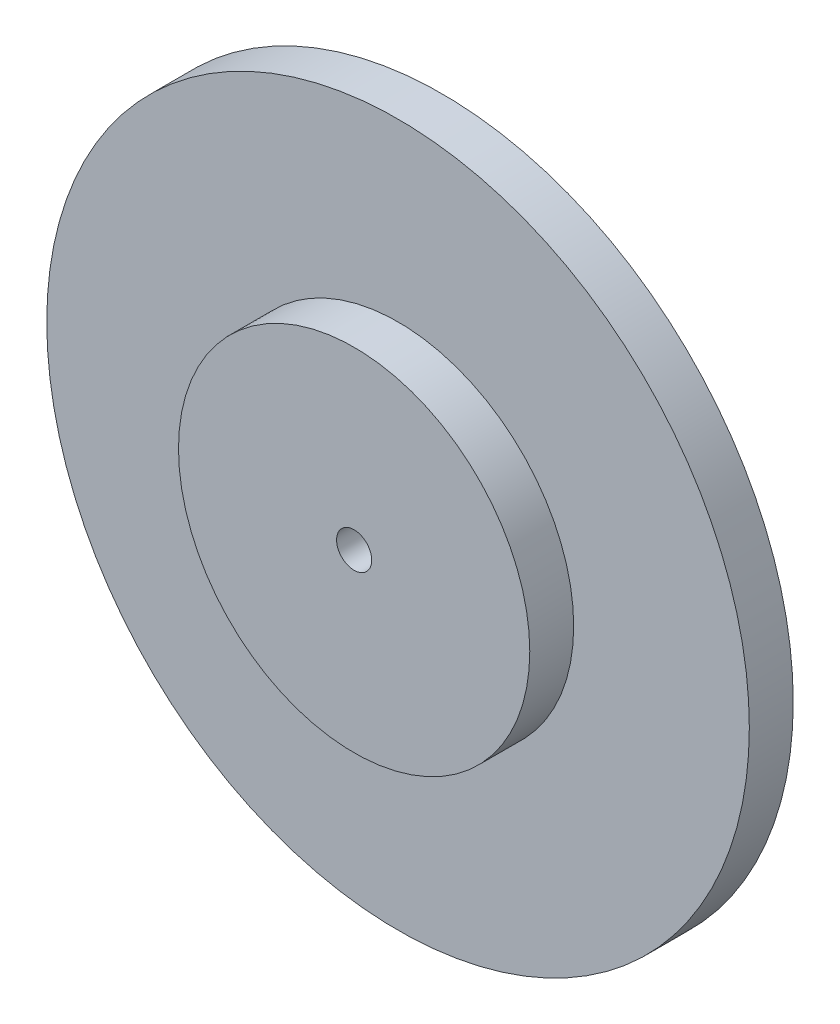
ISO-10303-21;
HEADER;
FILE_DESCRIPTION(('STEP AP214'),'2;1');
FILE_NAME('part.step','',(''),(''),'','','');
FILE_SCHEMA(('AUTOMOTIVE_DESIGN { 1 0 10303 214 1 1 1 1 }'));
ENDSEC;
DATA;
#1=APPLICATION_CONTEXT('core data for automotive mechanical design processes');
#2=APPLICATION_PROTOCOL_DEFINITION('international standard','automotive_design',2000,#1);
#3=PRODUCT_CONTEXT('',#1,'mechanical');
#4=PRODUCT('Part','Part','',(#3));
#5=PRODUCT_RELATED_PRODUCT_CATEGORY('part','',(#4));
#6=PRODUCT_DEFINITION_FORMATION('','',#4);
#7=PRODUCT_DEFINITION_CONTEXT('part definition',#1,'design');
#8=PRODUCT_DEFINITION('design','',#6,#7);
#9=PRODUCT_DEFINITION_SHAPE('','',#8);
#10=(LENGTH_UNIT() NAMED_UNIT(*) SI_UNIT(.MILLI.,.METRE.));
#11=(NAMED_UNIT(*) PLANE_ANGLE_UNIT() SI_UNIT($,.RADIAN.));
#12=(NAMED_UNIT(*) SI_UNIT($,.STERADIAN.) SOLID_ANGLE_UNIT());
#13=UNCERTAINTY_MEASURE_WITH_UNIT(LENGTH_MEASURE(1.E-05),#10,'distance_accuracy_value','');
#14=(GEOMETRIC_REPRESENTATION_CONTEXT(3) GLOBAL_UNCERTAINTY_ASSIGNED_CONTEXT((#13)) GLOBAL_UNIT_ASSIGNED_CONTEXT((#10,
#11,#12)) REPRESENTATION_CONTEXT('',''));
#15=CARTESIAN_POINT('',(0.,0.,0.));
#16=DIRECTION('',(0.,0.,1.));
#17=DIRECTION('',(1.,0.,0.));
#18=AXIS2_PLACEMENT_3D('',#15,#16,#17);
#19=CARTESIAN_POINT('',(0.,0.,6.35));
#20=DIRECTION('',(0.,0.,-1.));
#21=DIRECTION('',(-1.,0.,0.));
#22=AXIS2_PLACEMENT_3D('',#19,#20,#21);
#23=CYLINDRICAL_SURFACE('',#22,50.8);
#24=CARTESIAN_POINT('',(0.,0.,6.35));
#25=DIRECTION('',(0.,0.,1.));
#26=DIRECTION('',(1.,0.,0.));
#27=AXIS2_PLACEMENT_3D('',#24,#25,#26);
#28=CIRCLE('',#27,50.8);
#29=CARTESIAN_POINT('',(50.8,0.,6.35));
#30=VERTEX_POINT('',#29);
#31=EDGE_CURVE('E10',#30,#30,#28,.T.);
#32=ORIENTED_EDGE('',*,*,#31,.F.);
#33=EDGE_LOOP('',(#32));
#34=FACE_BOUND('',#33,.T.);
#35=CARTESIAN_POINT('',(0.,0.,0.));
#36=DIRECTION('',(0.,0.,1.));
#37=DIRECTION('',(1.,0.,0.));
#38=AXIS2_PLACEMENT_3D('',#35,#36,#37);
#39=CIRCLE('',#38,50.8);
#40=CARTESIAN_POINT('',(50.8,0.,0.));
#41=VERTEX_POINT('',#40);
#42=EDGE_CURVE('E33',#41,#41,#39,.T.);
#43=ORIENTED_EDGE('',*,*,#42,.T.);
#44=EDGE_LOOP('',(#43));
#45=FACE_BOUND('',#44,.T.);
#46=ADVANCED_FACE('F30',(#34,#45),#23,.T.);
#47=CARTESIAN_POINT('',(0.,0.,6.35));
#48=DIRECTION('',(0.,0.,1.));
#49=DIRECTION('',(1.,0.,0.));
#50=AXIS2_PLACEMENT_3D('',#47,#48,#49);
#51=PLANE('',#50);
#52=CARTESIAN_POINT('',(0.,0.,6.35));
#53=DIRECTION('',(0.,0.,1.));
#54=DIRECTION('',(1.,0.,0.));
#55=AXIS2_PLACEMENT_3D('',#52,#53,#54);
#56=CIRCLE('',#55,25.4);
#57=CARTESIAN_POINT('',(25.4,0.,6.35));
#58=VERTEX_POINT('',#57);
#59=EDGE_CURVE('E42',#58,#58,#56,.T.);
#60=ORIENTED_EDGE('',*,*,#59,.F.);
#61=EDGE_LOOP('',(#60));
#62=FACE_BOUND('',#61,.T.);
#63=ORIENTED_EDGE('',*,*,#31,.T.);
#64=EDGE_LOOP('',(#63));
#65=FACE_BOUND('',#64,.T.);
#66=ADVANCED_FACE('F75',(#62,#65),#51,.T.);
#67=CARTESIAN_POINT('',(0.,0.,0.));
#68=DIRECTION('',(0.,0.,1.));
#69=DIRECTION('',(1.,0.,0.));
#70=AXIS2_PLACEMENT_3D('',#67,#68,#69);
#71=PLANE('',#70);
#72=CARTESIAN_POINT('',(0.,0.,0.));
#73=DIRECTION('',(0.,0.,1.));
#74=DIRECTION('',(1.,0.,0.));
#75=AXIS2_PLACEMENT_3D('',#72,#73,#74);
#76=CIRCLE('',#75,2.54);
#77=CARTESIAN_POINT('',(2.54,0.,0.));
#78=VERTEX_POINT('',#77);
#79=EDGE_CURVE('E45',#78,#78,#76,.T.);
#80=ORIENTED_EDGE('',*,*,#79,.T.);
#81=EDGE_LOOP('',(#80));
#82=FACE_BOUND('',#81,.T.);
#83=ORIENTED_EDGE('',*,*,#42,.F.);
#84=EDGE_LOOP('',(#83));
#85=FACE_BOUND('',#84,.T.);
#86=ADVANCED_FACE('F54',(#82,#85),#71,.F.);
#87=CARTESIAN_POINT('',(0.,0.,12.7));
#88=DIRECTION('',(0.,0.,-1.));
#89=DIRECTION('',(-1.,0.,0.));
#90=AXIS2_PLACEMENT_3D('',#87,#88,#89);
#91=CYLINDRICAL_SURFACE('',#90,25.4);
#92=CARTESIAN_POINT('',(0.,0.,12.7));
#93=DIRECTION('',(0.,0.,1.));
#94=DIRECTION('',(1.,0.,0.));
#95=AXIS2_PLACEMENT_3D('',#92,#93,#94);
#96=CIRCLE('',#95,25.4);
#97=CARTESIAN_POINT('',(25.4,0.,12.7));
#98=VERTEX_POINT('',#97);
#99=EDGE_CURVE('E40',#98,#98,#96,.T.);
#100=ORIENTED_EDGE('',*,*,#99,.F.);
#101=EDGE_LOOP('',(#100));
#102=FACE_BOUND('',#101,.T.);
#103=ORIENTED_EDGE('',*,*,#59,.T.);
#104=EDGE_LOOP('',(#103));
#105=FACE_BOUND('',#104,.T.);
#106=ADVANCED_FACE('F66',(#102,#105),#91,.T.);
#107=CARTESIAN_POINT('',(0.,0.,12.7));
#108=DIRECTION('',(0.,0.,1.));
#109=DIRECTION('',(1.,0.,0.));
#110=AXIS2_PLACEMENT_3D('',#107,#108,#109);
#111=PLANE('',#110);
#112=CARTESIAN_POINT('',(0.,0.,12.7));
#113=DIRECTION('',(0.,0.,1.));
#114=DIRECTION('',(1.,0.,0.));
#115=AXIS2_PLACEMENT_3D('',#112,#113,#114);
#116=CIRCLE('',#115,2.54);
#117=CARTESIAN_POINT('',(2.54,0.,12.7));
#118=VERTEX_POINT('',#117);
#119=EDGE_CURVE('E48',#118,#118,#116,.T.);
#120=ORIENTED_EDGE('',*,*,#119,.F.);
#121=EDGE_LOOP('',(#120));
#122=FACE_BOUND('',#121,.T.);
#123=ORIENTED_EDGE('',*,*,#99,.T.);
#124=EDGE_LOOP('',(#123));
#125=FACE_BOUND('',#124,.T.);
#126=ADVANCED_FACE('F60',(#122,#125),#111,.T.);
#127=CARTESIAN_POINT('',(0.,0.,0.));
#128=DIRECTION('',(0.,0.,1.));
#129=DIRECTION('',(1.,0.,0.));
#130=AXIS2_PLACEMENT_3D('',#127,#128,#129);
#131=CYLINDRICAL_SURFACE('',#130,2.54);
#132=ORIENTED_EDGE('',*,*,#79,.F.);
#133=EDGE_LOOP('',(#132));
#134=FACE_BOUND('',#133,.T.);
#135=ORIENTED_EDGE('',*,*,#119,.T.);
#136=EDGE_LOOP('',(#135));
#137=FACE_BOUND('',#136,.T.);
#138=ADVANCED_FACE('F57',(#134,#137),#131,.F.);
#139=CLOSED_SHELL('',(#46,#66,#86,#106,#126,#138));
#140=MANIFOLD_SOLID_BREP('B2',#139);
#141=ADVANCED_BREP_SHAPE_REPRESENTATION('',(#18,#140),#14);
#142=SHAPE_DEFINITION_REPRESENTATION(#9,#141);
ENDSEC;
END-ISO-10303-21;
